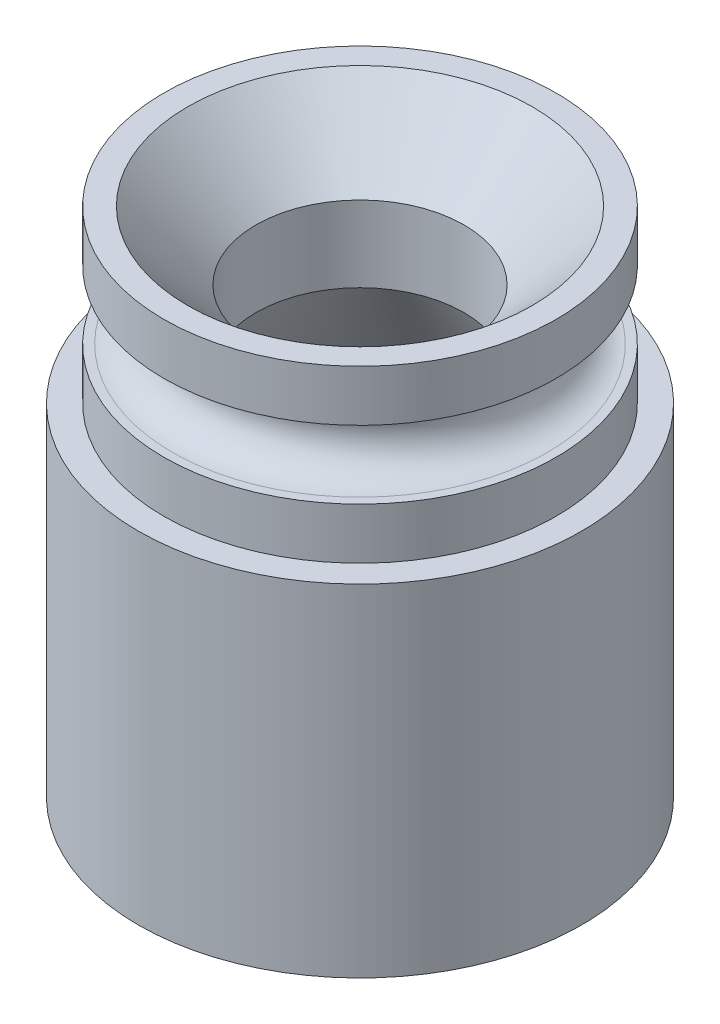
ISO-10303-21;
HEADER;
FILE_DESCRIPTION(('STEP AP214'),'2;1');
FILE_NAME('part.step','',(''),(''),'','','');
FILE_SCHEMA(('AUTOMOTIVE_DESIGN { 1 0 10303 214 1 1 1 1 }'));
ENDSEC;
DATA;
#1=APPLICATION_CONTEXT('core data for automotive mechanical design processes');
#2=APPLICATION_PROTOCOL_DEFINITION('international standard','automotive_design',2000,#1);
#3=PRODUCT_CONTEXT('',#1,'mechanical');
#4=PRODUCT('Part','Part','',(#3));
#5=PRODUCT_RELATED_PRODUCT_CATEGORY('part','',(#4));
#6=PRODUCT_DEFINITION_FORMATION('','',#4);
#7=PRODUCT_DEFINITION_CONTEXT('part definition',#1,'design');
#8=PRODUCT_DEFINITION('design','',#6,#7);
#9=PRODUCT_DEFINITION_SHAPE('','',#8);
#10=(LENGTH_UNIT() NAMED_UNIT(*) SI_UNIT(.MILLI.,.METRE.));
#11=(NAMED_UNIT(*) PLANE_ANGLE_UNIT() SI_UNIT($,.RADIAN.));
#12=(NAMED_UNIT(*) SI_UNIT($,.STERADIAN.) SOLID_ANGLE_UNIT());
#13=UNCERTAINTY_MEASURE_WITH_UNIT(LENGTH_MEASURE(1.E-05),#10,'distance_accuracy_value','');
#14=(GEOMETRIC_REPRESENTATION_CONTEXT(3) GLOBAL_UNCERTAINTY_ASSIGNED_CONTEXT((#13)) GLOBAL_UNIT_ASSIGNED_CONTEXT((#10,
#11,#12)) REPRESENTATION_CONTEXT('',''));
#15=CARTESIAN_POINT('',(0.,0.,0.));
#16=DIRECTION('',(0.,0.,1.));
#17=DIRECTION('',(1.,0.,0.));
#18=AXIS2_PLACEMENT_3D('',#15,#16,#17);
#19=CARTESIAN_POINT('',(0.,0.5,0.));
#20=DIRECTION('',(0.,1.,0.));
#21=DIRECTION('',(0.,0.,1.));
#22=AXIS2_PLACEMENT_3D('',#19,#20,#21);
#23=CYLINDRICAL_SURFACE('',#22,5.75);
#24=CARTESIAN_POINT('',(0.,2.,0.));
#25=DIRECTION('',(0.,1.,0.));
#26=DIRECTION('',(0.,0.,1.));
#27=AXIS2_PLACEMENT_3D('',#24,#25,#26);
#28=CIRCLE('',#27,5.75);
#29=CARTESIAN_POINT('',(0.,2.,5.75));
#30=VERTEX_POINT('',#29);
#31=EDGE_CURVE('E8',#30,#30,#28,.T.);
#32=ORIENTED_EDGE('',*,*,#31,.F.);
#33=EDGE_LOOP('',(#32));
#34=FACE_BOUND('',#33,.T.);
#35=CARTESIAN_POINT('',(0.,0.5,0.));
#36=DIRECTION('',(0.,-1.,0.));
#37=DIRECTION('',(0.,0.,-1.));
#38=AXIS2_PLACEMENT_3D('',#35,#36,#37);
#39=CIRCLE('',#38,5.75);
#40=CARTESIAN_POINT('',(0.,0.5,-5.75));
#41=VERTEX_POINT('',#40);
#42=EDGE_CURVE('E56',#41,#41,#39,.T.);
#43=ORIENTED_EDGE('',*,*,#42,.F.);
#44=EDGE_LOOP('',(#43));
#45=FACE_BOUND('',#44,.T.);
#46=ADVANCED_FACE('F12',(#34,#45),#23,.T.);
#47=CARTESIAN_POINT('',(0.,-1.5,0.));
#48=DIRECTION('',(0.,-1.,0.));
#49=DIRECTION('',(0.,0.,-1.));
#50=AXIS2_PLACEMENT_3D('',#47,#48,#49);
#51=CIRCLE('',#50,5.75);
#52=CARTESIAN_POINT('',(0.,-1.5,-5.75));
#53=VERTEX_POINT('',#52);
#54=EDGE_CURVE('E53',#53,#53,#51,.T.);
#55=ORIENTED_EDGE('',*,*,#54,.T.);
#56=EDGE_LOOP('',(#55));
#57=FACE_BOUND('',#56,.T.);
#58=CARTESIAN_POINT('',(0.,-3.,0.));
#59=DIRECTION('',(0.,1.,0.));
#60=DIRECTION('',(0.,0.,1.));
#61=AXIS2_PLACEMENT_3D('',#58,#59,#60);
#62=CIRCLE('',#61,5.75);
#63=CARTESIAN_POINT('',(0.,-3.,5.75));
#64=VERTEX_POINT('',#63);
#65=EDGE_CURVE('E44',#64,#64,#62,.T.);
#66=ORIENTED_EDGE('',*,*,#65,.T.);
#67=EDGE_LOOP('',(#66));
#68=FACE_BOUND('',#67,.T.);
#69=ADVANCED_FACE('F64',(#57,#68),#23,.T.);
#70=CARTESIAN_POINT('',(-6.5,-3.,0.));
#71=DIRECTION('',(0.,1.,0.));
#72=DIRECTION('',(0.,0.,1.));
#73=AXIS2_PLACEMENT_3D('',#70,#71,#72);
#74=PLANE('',#73);
#75=CARTESIAN_POINT('',(0.,-3.,0.));
#76=DIRECTION('',(0.,1.,0.));
#77=DIRECTION('',(0.,0.,1.));
#78=AXIS2_PLACEMENT_3D('',#75,#76,#77);
#79=CIRCLE('',#78,6.5);
#80=CARTESIAN_POINT('',(0.,-3.,6.5));
#81=VERTEX_POINT('',#80);
#82=EDGE_CURVE('E27',#81,#81,#79,.T.);
#83=ORIENTED_EDGE('',*,*,#82,.T.);
#84=EDGE_LOOP('',(#83));
#85=FACE_BOUND('',#84,.T.);
#86=ORIENTED_EDGE('',*,*,#65,.F.);
#87=EDGE_LOOP('',(#86));
#88=FACE_BOUND('',#87,.T.);
#89=ADVANCED_FACE('F72',(#85,#88),#74,.T.);
#90=CARTESIAN_POINT('',(0.,0.5,0.));
#91=DIRECTION('',(0.,1.,0.));
#92=DIRECTION('',(0.,0.,1.));
#93=AXIS2_PLACEMENT_3D('',#90,#91,#92);
#94=CYLINDRICAL_SURFACE('',#93,6.5);
#95=CARTESIAN_POINT('',(0.,-13.,0.));
#96=DIRECTION('',(0.,1.,0.));
#97=DIRECTION('',(0.,0.,1.));
#98=AXIS2_PLACEMENT_3D('',#95,#96,#97);
#99=CIRCLE('',#98,6.5);
#100=CARTESIAN_POINT('',(0.,-13.,6.5));
#101=VERTEX_POINT('',#100);
#102=EDGE_CURVE('E32',#101,#101,#99,.T.);
#103=ORIENTED_EDGE('',*,*,#102,.T.);
#104=EDGE_LOOP('',(#103));
#105=FACE_BOUND('',#104,.T.);
#106=ORIENTED_EDGE('',*,*,#82,.F.);
#107=EDGE_LOOP('',(#106));
#108=FACE_BOUND('',#107,.T.);
#109=ADVANCED_FACE('F95',(#105,#108),#94,.T.);
#110=CARTESIAN_POINT('',(-5.,-13.,0.));
#111=DIRECTION('',(0.,-1.,0.));
#112=DIRECTION('',(0.,0.,-1.));
#113=AXIS2_PLACEMENT_3D('',#110,#111,#112);
#114=PLANE('',#113);
#115=CARTESIAN_POINT('',(0.,-13.,0.));
#116=DIRECTION('',(0.,1.,0.));
#117=DIRECTION('',(0.,0.,1.));
#118=AXIS2_PLACEMENT_3D('',#115,#116,#117);
#119=CIRCLE('',#118,5.);
#120=CARTESIAN_POINT('',(0.,-13.,5.));
#121=VERTEX_POINT('',#120);
#122=EDGE_CURVE('E35',#121,#121,#119,.T.);
#123=ORIENTED_EDGE('',*,*,#122,.T.);
#124=EDGE_LOOP('',(#123));
#125=FACE_BOUND('',#124,.T.);
#126=ORIENTED_EDGE('',*,*,#102,.F.);
#127=EDGE_LOOP('',(#126));
#128=FACE_BOUND('',#127,.T.);
#129=ADVANCED_FACE('F91',(#125,#128),#114,.T.);
#130=CARTESIAN_POINT('',(0.,0.5,0.));
#131=DIRECTION('',(0.,1.,0.));
#132=DIRECTION('',(0.,0.,1.));
#133=AXIS2_PLACEMENT_3D('',#130,#131,#132);
#134=CYLINDRICAL_SURFACE('',#133,5.);
#135=CARTESIAN_POINT('',(0.,-5.60429399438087,0.));
#136=DIRECTION('',(0.,1.,0.));
#137=DIRECTION('',(0.,0.,1.));
#138=AXIS2_PLACEMENT_3D('',#135,#136,#137);
#139=CIRCLE('',#138,5.);
#140=CARTESIAN_POINT('',(0.,-5.60429399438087,5.));
#141=VERTEX_POINT('',#140);
#142=EDGE_CURVE('E38',#141,#141,#139,.T.);
#143=ORIENTED_EDGE('',*,*,#142,.T.);
#144=EDGE_LOOP('',(#143));
#145=FACE_BOUND('',#144,.T.);
#146=ORIENTED_EDGE('',*,*,#122,.F.);
#147=EDGE_LOOP('',(#146));
#148=FACE_BOUND('',#147,.T.);
#149=ADVANCED_FACE('F87',(#145,#148),#134,.F.);
#150=CARTESIAN_POINT('',(0.,-5.60429399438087,0.));
#151=DIRECTION('',(0.,-1.,0.));
#152=DIRECTION('',(0.,0.,-1.));
#153=AXIS2_PLACEMENT_3D('',#150,#151,#152);
#154=CONICAL_SURFACE('',#153,5.,0.523598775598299);
#155=CARTESIAN_POINT('',(0.,-2.22679491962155,0.));
#156=DIRECTION('',(0.,1.,0.));
#157=DIRECTION('',(0.,0.,1.));
#158=AXIS2_PLACEMENT_3D('',#155,#156,#157);
#159=CIRCLE('',#158,3.05);
#160=CARTESIAN_POINT('',(0.,-2.22679491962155,3.05));
#161=VERTEX_POINT('',#160);
#162=EDGE_CURVE('E41',#161,#161,#159,.T.);
#163=ORIENTED_EDGE('',*,*,#162,.T.);
#164=EDGE_LOOP('',(#163));
#165=FACE_BOUND('',#164,.T.);
#166=ORIENTED_EDGE('',*,*,#142,.F.);
#167=EDGE_LOOP('',(#166));
#168=FACE_BOUND('',#167,.T.);
#169=ADVANCED_FACE('F83',(#165,#168),#154,.F.);
#170=CARTESIAN_POINT('',(0.,0.5,0.));
#171=DIRECTION('',(0.,1.,0.));
#172=DIRECTION('',(0.,0.,1.));
#173=AXIS2_PLACEMENT_3D('',#170,#171,#172);
#174=CYLINDRICAL_SURFACE('',#173,3.05);
#175=CARTESIAN_POINT('',(0.,0.,0.));
#176=DIRECTION('',(0.,1.,0.));
#177=DIRECTION('',(0.,0.,1.));
#178=AXIS2_PLACEMENT_3D('',#175,#176,#177);
#179=CIRCLE('',#178,3.05);
#180=CARTESIAN_POINT('',(0.,0.,3.05));
#181=VERTEX_POINT('',#180);
#182=EDGE_CURVE('E23',#181,#181,#179,.T.);
#183=ORIENTED_EDGE('',*,*,#182,.T.);
#184=EDGE_LOOP('',(#183));
#185=FACE_BOUND('',#184,.T.);
#186=ORIENTED_EDGE('',*,*,#162,.F.);
#187=EDGE_LOOP('',(#186));
#188=FACE_BOUND('',#187,.T.);
#189=ADVANCED_FACE('F80',(#185,#188),#174,.F.);
#190=CARTESIAN_POINT('',(-5.75,2.,0.));
#191=DIRECTION('',(0.,1.,0.));
#192=DIRECTION('',(0.,0.,1.));
#193=AXIS2_PLACEMENT_3D('',#190,#191,#192);
#194=PLANE('',#193);
#195=ORIENTED_EDGE('',*,*,#31,.T.);
#196=EDGE_LOOP('',(#195));
#197=FACE_BOUND('',#196,.T.);
#198=CARTESIAN_POINT('',(0.,2.,0.));
#199=DIRECTION('',(0.,1.,0.));
#200=DIRECTION('',(0.,0.,1.));
#201=AXIS2_PLACEMENT_3D('',#198,#199,#200);
#202=CIRCLE('',#201,5.05);
#203=CARTESIAN_POINT('',(0.,2.,5.05));
#204=VERTEX_POINT('',#203);
#205=EDGE_CURVE('E19',#204,#204,#202,.F.);
#206=ORIENTED_EDGE('',*,*,#205,.T.);
#207=EDGE_LOOP('',(#206));
#208=FACE_BOUND('',#207,.T.);
#209=ADVANCED_FACE('F77',(#197,#208),#194,.T.);
#210=CARTESIAN_POINT('',(0.,0.,0.));
#211=DIRECTION('',(0.,1.,0.));
#212=DIRECTION('',(0.,0.,1.));
#213=AXIS2_PLACEMENT_3D('',#210,#211,#212);
#214=CONICAL_SURFACE('',#213,3.05,0.78539816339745);
#215=ORIENTED_EDGE('',*,*,#205,.F.);
#216=EDGE_LOOP('',(#215));
#217=FACE_BOUND('',#216,.T.);
#218=ORIENTED_EDGE('',*,*,#182,.F.);
#219=EDGE_LOOP('',(#218));
#220=FACE_BOUND('',#219,.T.);
#221=ADVANCED_FACE('F14',(#217,#220),#214,.F.);
#222=CARTESIAN_POINT('',(0.,0.5,0.));
#223=DIRECTION('',(0.,-1.,0.));
#224=DIRECTION('',(0.,0.,-1.));
#225=AXIS2_PLACEMENT_3D('',#222,#223,#224);
#226=PLANE('',#225);
#227=ORIENTED_EDGE('',*,*,#42,.T.);
#228=EDGE_LOOP('',(#227));
#229=FACE_BOUND('',#228,.T.);
#230=CARTESIAN_POINT('',(0.,0.5,0.));
#231=DIRECTION('',(0.,-1.,0.));
#232=DIRECTION('',(0.,0.,-1.));
#233=AXIS2_PLACEMENT_3D('',#230,#231,#232);
#234=CIRCLE('',#233,5.5);
#235=CARTESIAN_POINT('',(0.,0.5,-5.5));
#236=VERTEX_POINT('',#235);
#237=EDGE_CURVE('E47',#236,#236,#234,.T.);
#238=ORIENTED_EDGE('',*,*,#237,.F.);
#239=EDGE_LOOP('',(#238));
#240=FACE_BOUND('',#239,.T.);
#241=ADVANCED_FACE('F60',(#229,#240),#226,.T.);
#242=CARTESIAN_POINT('',(0.,-0.5,0.));
#243=DIRECTION('',(0.,-1.,0.));
#244=DIRECTION('',(0.,0.,-1.));
#245=AXIS2_PLACEMENT_3D('',#242,#243,#244);
#246=TOROIDAL_SURFACE('',#245,5.5,1.);
#247=CARTESIAN_POINT('',(0.,-1.5,0.));
#248=DIRECTION('',(0.,-1.,0.));
#249=DIRECTION('',(0.,0.,-1.));
#250=AXIS2_PLACEMENT_3D('',#247,#248,#249);
#251=CIRCLE('',#250,5.5);
#252=CARTESIAN_POINT('',(0.,-1.5,-5.5));
#253=VERTEX_POINT('',#252);
#254=EDGE_CURVE('E50',#253,#253,#251,.T.);
#255=ORIENTED_EDGE('',*,*,#254,.F.);
#256=EDGE_LOOP('',(#255));
#257=FACE_BOUND('',#256,.T.);
#258=ORIENTED_EDGE('',*,*,#237,.T.);
#259=EDGE_LOOP('',(#258));
#260=FACE_BOUND('',#259,.T.);
#261=ADVANCED_FACE('F159',(#257,#260),#246,.F.);
#262=CARTESIAN_POINT('',(0.,-1.5,0.));
#263=DIRECTION('',(0.,-1.,0.));
#264=DIRECTION('',(0.,0.,-1.));
#265=AXIS2_PLACEMENT_3D('',#262,#263,#264);
#266=PLANE('',#265);
#267=ORIENTED_EDGE('',*,*,#54,.F.);
#268=EDGE_LOOP('',(#267));
#269=FACE_BOUND('',#268,.T.);
#270=ORIENTED_EDGE('',*,*,#254,.T.);
#271=EDGE_LOOP('',(#270));
#272=FACE_BOUND('',#271,.T.);
#273=ADVANCED_FACE('F166',(#269,#272),#266,.F.);
#274=CLOSED_SHELL('',(#46,#69,#89,#109,#129,#149,#169,#189,#209,#221,#241,#261,#273));
#275=MANIFOLD_SOLID_BREP('B1',#274);
#276=ADVANCED_BREP_SHAPE_REPRESENTATION('',(#18,#275),#14);
#277=SHAPE_DEFINITION_REPRESENTATION(#9,#276);
ENDSEC;
END-ISO-10303-21;
